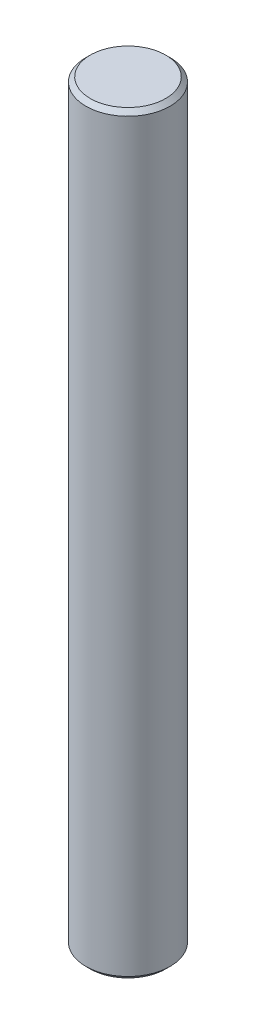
ISO-10303-21;
HEADER;
FILE_DESCRIPTION(('STEP AP214'),'2;1');
FILE_NAME('part.step','',(''),(''),'','','');
FILE_SCHEMA(('AUTOMOTIVE_DESIGN { 1 0 10303 214 1 1 1 1 }'));
ENDSEC;
DATA;
#1=APPLICATION_CONTEXT('core data for automotive mechanical design processes');
#2=APPLICATION_PROTOCOL_DEFINITION('international standard','automotive_design',2000,#1);
#3=PRODUCT_CONTEXT('',#1,'mechanical');
#4=PRODUCT('Part','Part','',(#3));
#5=PRODUCT_RELATED_PRODUCT_CATEGORY('part','',(#4));
#6=PRODUCT_DEFINITION_FORMATION('','',#4);
#7=PRODUCT_DEFINITION_CONTEXT('part definition',#1,'design');
#8=PRODUCT_DEFINITION('design','',#6,#7);
#9=PRODUCT_DEFINITION_SHAPE('','',#8);
#10=(LENGTH_UNIT() NAMED_UNIT(*) SI_UNIT(.MILLI.,.METRE.));
#11=(NAMED_UNIT(*) PLANE_ANGLE_UNIT() SI_UNIT($,.RADIAN.));
#12=(NAMED_UNIT(*) SI_UNIT($,.STERADIAN.) SOLID_ANGLE_UNIT());
#13=UNCERTAINTY_MEASURE_WITH_UNIT(LENGTH_MEASURE(1.E-05),#10,'distance_accuracy_value','');
#14=(GEOMETRIC_REPRESENTATION_CONTEXT(3) GLOBAL_UNCERTAINTY_ASSIGNED_CONTEXT((#13)) GLOBAL_UNIT_ASSIGNED_CONTEXT((#10,
#11,#12)) REPRESENTATION_CONTEXT('',''));
#15=CARTESIAN_POINT('',(0.,0.,0.));
#16=DIRECTION('',(0.,0.,1.));
#17=DIRECTION('',(1.,0.,0.));
#18=AXIS2_PLACEMENT_3D('',#15,#16,#17);
#19=CARTESIAN_POINT('',(0.,21.59,0.));
#20=DIRECTION('',(0.,-1.,0.));
#21=DIRECTION('',(0.,0.,-1.));
#22=AXIS2_PLACEMENT_3D('',#19,#20,#21);
#23=CYLINDRICAL_SURFACE('',#22,2.413);
#24=CARTESIAN_POINT('',(0.,-21.336,0.));
#25=DIRECTION('',(0.,1.,0.));
#26=DIRECTION('',(0.,0.,1.));
#27=AXIS2_PLACEMENT_3D('',#24,#25,#26);
#28=CIRCLE('',#27,2.413);
#29=CARTESIAN_POINT('',(0.,-21.336,2.413));
#30=VERTEX_POINT('',#29);
#31=EDGE_CURVE('E42',#30,#30,#28,.T.);
#32=ORIENTED_EDGE('',*,*,#31,.T.);
#33=EDGE_LOOP('',(#32));
#34=FACE_BOUND('',#33,.T.);
#35=CARTESIAN_POINT('',(0.,21.336,0.));
#36=DIRECTION('',(0.,1.,0.));
#37=DIRECTION('',(0.,0.,1.));
#38=AXIS2_PLACEMENT_3D('',#35,#36,#37);
#39=CIRCLE('',#38,2.413);
#40=CARTESIAN_POINT('',(0.,21.336,2.413));
#41=VERTEX_POINT('',#40);
#42=EDGE_CURVE('E46',#41,#41,#39,.F.);
#43=ORIENTED_EDGE('',*,*,#42,.T.);
#44=EDGE_LOOP('',(#43));
#45=FACE_BOUND('',#44,.T.);
#46=ADVANCED_FACE('F31',(#34,#45),#23,.T.);
#47=CARTESIAN_POINT('',(0.,21.59,0.));
#48=DIRECTION('',(0.,1.,0.));
#49=DIRECTION('',(0.,0.,1.));
#50=AXIS2_PLACEMENT_3D('',#47,#48,#49);
#51=PLANE('',#50);
#52=CARTESIAN_POINT('',(0.,21.59,0.));
#53=DIRECTION('',(0.,1.,0.));
#54=DIRECTION('',(0.,0.,1.));
#55=AXIS2_PLACEMENT_3D('',#52,#53,#54);
#56=CIRCLE('',#55,2.159);
#57=CARTESIAN_POINT('',(0.,21.59,2.159));
#58=VERTEX_POINT('',#57);
#59=EDGE_CURVE('E10',#58,#58,#56,.T.);
#60=ORIENTED_EDGE('',*,*,#59,.T.);
#61=EDGE_LOOP('',(#60));
#62=FACE_BOUND('',#61,.T.);
#63=ADVANCED_FACE('F62',(#62),#51,.T.);
#64=CARTESIAN_POINT('',(0.,-21.59,0.));
#65=DIRECTION('',(0.,1.,0.));
#66=DIRECTION('',(0.,0.,1.));
#67=AXIS2_PLACEMENT_3D('',#64,#65,#66);
#68=PLANE('',#67);
#69=CARTESIAN_POINT('',(0.,-21.59,0.));
#70=DIRECTION('',(0.,1.,0.));
#71=DIRECTION('',(0.,0.,1.));
#72=AXIS2_PLACEMENT_3D('',#69,#70,#71);
#73=CIRCLE('',#72,2.159);
#74=CARTESIAN_POINT('',(0.,-21.59,2.159));
#75=VERTEX_POINT('',#74);
#76=EDGE_CURVE('E38',#75,#75,#73,.F.);
#77=ORIENTED_EDGE('',*,*,#76,.T.);
#78=EDGE_LOOP('',(#77));
#79=FACE_BOUND('',#78,.T.);
#80=ADVANCED_FACE('F59',(#79),#68,.F.);
#81=CARTESIAN_POINT('',(0.,-21.336,0.));
#82=DIRECTION('',(0.,1.,0.));
#83=DIRECTION('',(0.,0.,1.));
#84=AXIS2_PLACEMENT_3D('',#81,#82,#83);
#85=CONICAL_SURFACE('',#84,2.413,0.785398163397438);
#86=ORIENTED_EDGE('',*,*,#76,.F.);
#87=EDGE_LOOP('',(#86));
#88=FACE_BOUND('',#87,.T.);
#89=ORIENTED_EDGE('',*,*,#31,.F.);
#90=EDGE_LOOP('',(#89));
#91=FACE_BOUND('',#90,.T.);
#92=ADVANCED_FACE('F55',(#88,#91),#85,.T.);
#93=CARTESIAN_POINT('',(0.,21.59,0.));
#94=DIRECTION('',(0.,-1.,0.));
#95=DIRECTION('',(0.,0.,-1.));
#96=AXIS2_PLACEMENT_3D('',#93,#94,#95);
#97=CONICAL_SURFACE('',#96,2.159,0.785398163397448);
#98=ORIENTED_EDGE('',*,*,#42,.F.);
#99=EDGE_LOOP('',(#98));
#100=FACE_BOUND('',#99,.T.);
#101=ORIENTED_EDGE('',*,*,#59,.F.);
#102=EDGE_LOOP('',(#101));
#103=FACE_BOUND('',#102,.T.);
#104=ADVANCED_FACE('F33',(#100,#103),#97,.T.);
#105=CLOSED_SHELL('',(#46,#63,#80,#92,#104));
#106=MANIFOLD_SOLID_BREP('B2',#105);
#107=ADVANCED_BREP_SHAPE_REPRESENTATION('',(#18,#106),#14);
#108=SHAPE_DEFINITION_REPRESENTATION(#9,#107);
ENDSEC;
END-ISO-10303-21;
